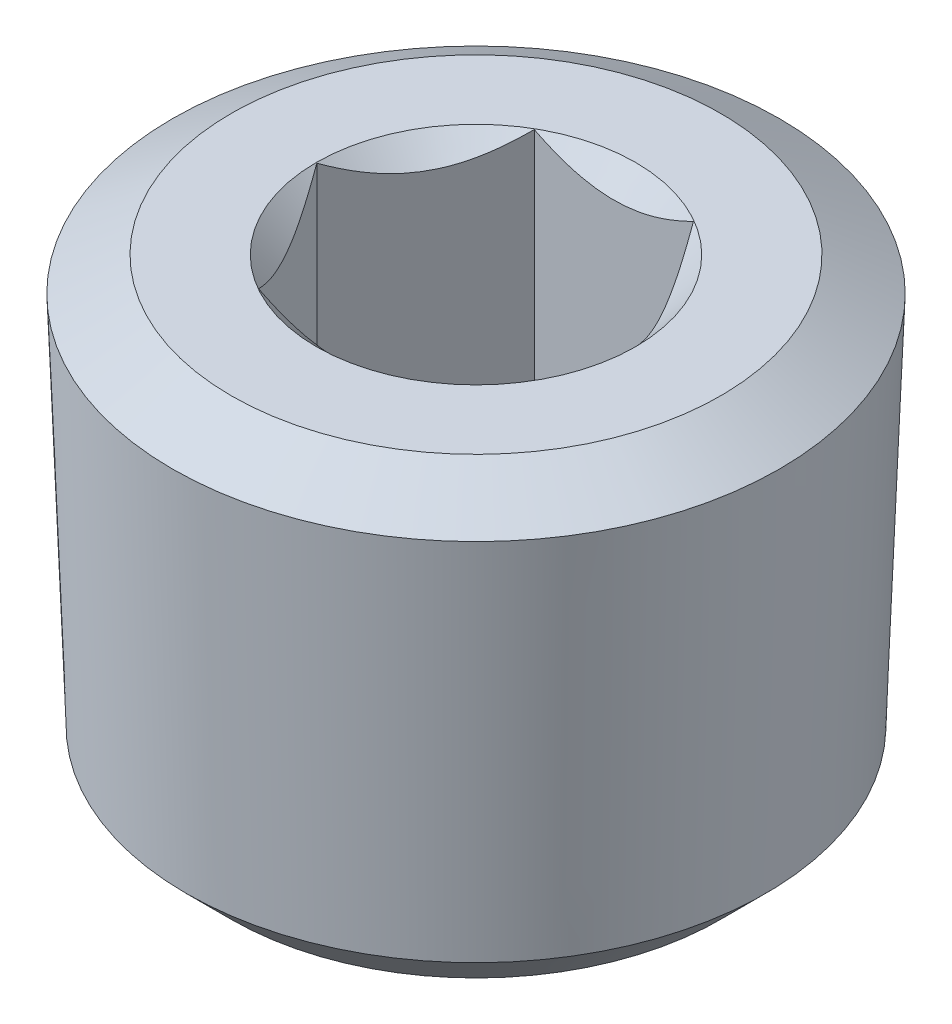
ISO-10303-21;
HEADER;
FILE_DESCRIPTION(('STEP AP214'),'2;1');
FILE_NAME('part.step','',(''),(''),'','','');
FILE_SCHEMA(('AUTOMOTIVE_DESIGN { 1 0 10303 214 1 1 1 1 }'));
ENDSEC;
DATA;
#1=APPLICATION_CONTEXT('core data for automotive mechanical design processes');
#2=APPLICATION_PROTOCOL_DEFINITION('international standard','automotive_design',2000,#1);
#3=PRODUCT_CONTEXT('',#1,'mechanical');
#4=PRODUCT('Part','Part','',(#3));
#5=PRODUCT_RELATED_PRODUCT_CATEGORY('part','',(#4));
#6=PRODUCT_DEFINITION_FORMATION('','',#4);
#7=PRODUCT_DEFINITION_CONTEXT('part definition',#1,'design');
#8=PRODUCT_DEFINITION('design','',#6,#7);
#9=PRODUCT_DEFINITION_SHAPE('','',#8);
#10=(LENGTH_UNIT() NAMED_UNIT(*) SI_UNIT(.MILLI.,.METRE.));
#11=(NAMED_UNIT(*) PLANE_ANGLE_UNIT() SI_UNIT($,.RADIAN.));
#12=(NAMED_UNIT(*) SI_UNIT($,.STERADIAN.) SOLID_ANGLE_UNIT());
#13=UNCERTAINTY_MEASURE_WITH_UNIT(LENGTH_MEASURE(1.E-05),#10,'distance_accuracy_value','');
#14=(GEOMETRIC_REPRESENTATION_CONTEXT(3) GLOBAL_UNCERTAINTY_ASSIGNED_CONTEXT((#13)) GLOBAL_UNIT_ASSIGNED_CONTEXT((#10,
#11,#12)) REPRESENTATION_CONTEXT('',''));
#15=CARTESIAN_POINT('',(0.,0.,0.));
#16=DIRECTION('',(0.,0.,1.));
#17=DIRECTION('',(1.,0.,0.));
#18=AXIS2_PLACEMENT_3D('',#15,#16,#17);
#19=CARTESIAN_POINT('',(0.,0.,0.));
#20=DIRECTION('',(0.,1.,0.));
#21=DIRECTION('',(0.,0.,1.));
#22=AXIS2_PLACEMENT_3D('',#19,#20,#21);
#23=PLANE('',#22);
#24=CARTESIAN_POINT('',(0.,0.,0.));
#25=DIRECTION('',(0.,1.,0.));
#26=DIRECTION('',(0.,0.,1.));
#27=AXIS2_PLACEMENT_3D('',#24,#25,#26);
#28=CIRCLE('',#27,5.588);
#29=CARTESIAN_POINT('',(0.,0.,5.588));
#30=VERTEX_POINT('',#29);
#31=EDGE_CURVE('E238',#30,#30,#28,.T.);
#32=ORIENTED_EDGE('',*,*,#31,.F.);
#33=EDGE_LOOP('',(#32));
#34=FACE_BOUND('',#33,.T.);
#35=CARTESIAN_POINT('',(0.,0.,0.));
#36=DIRECTION('',(0.,1.,0.));
#37=DIRECTION('',(0.,0.,1.));
#38=AXIS2_PLACEMENT_3D('',#35,#36,#37);
#39=CIRCLE('',#38,8.56521947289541);
#40=CARTESIAN_POINT('',(0.,0.,8.56521947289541));
#41=VERTEX_POINT('',#40);
#42=EDGE_CURVE('E12',#41,#41,#39,.T.);
#43=ORIENTED_EDGE('',*,*,#42,.T.);
#44=EDGE_LOOP('',(#43));
#45=FACE_BOUND('',#44,.T.);
#46=ADVANCED_FACE('F33',(#34,#45),#23,.T.);
#47=CARTESIAN_POINT('',(0.,0.,0.));
#48=DIRECTION('',(0.,-1.,0.));
#49=DIRECTION('',(0.,0.,-1.));
#50=AXIS2_PLACEMENT_3D('',#47,#48,#49);
#51=CONICAL_SURFACE('',#50,8.56521947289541,1.0471975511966);
#52=CARTESIAN_POINT('',(0.,-1.18901290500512,0.));
#53=DIRECTION('',(0.,1.,0.));
#54=DIRECTION('',(0.,0.,1.));
#55=AXIS2_PLACEMENT_3D('',#52,#53,#54);
#56=CIRCLE('',#55,10.6246502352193);
#57=CARTESIAN_POINT('',(0.,-1.18901290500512,10.6246502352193));
#58=VERTEX_POINT('',#57);
#59=EDGE_CURVE('E40',#58,#58,#56,.T.);
#60=ORIENTED_EDGE('',*,*,#59,.T.);
#61=EDGE_LOOP('',(#60));
#62=FACE_BOUND('',#61,.T.);
#63=ORIENTED_EDGE('',*,*,#42,.F.);
#64=EDGE_LOOP('',(#63));
#65=FACE_BOUND('',#64,.T.);
#66=ADVANCED_FACE('F228',(#62,#65),#51,.T.);
#67=CARTESIAN_POINT('',(0.,-1.18901290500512,0.));
#68=DIRECTION('',(0.,1.,0.));
#69=DIRECTION('',(0.,0.,1.));
#70=AXIS2_PLACEMENT_3D('',#67,#68,#69);
#71=CONICAL_SURFACE('',#70,10.6246502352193,0.0364424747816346);
#72=CARTESIAN_POINT('',(0.,-14.2933346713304,0.));
#73=DIRECTION('',(0.,1.,0.));
#74=DIRECTION('',(0.,0.,1.));
#75=AXIS2_PLACEMENT_3D('',#72,#73,#74);
#76=CIRCLE('',#75,10.146884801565);
#77=CARTESIAN_POINT('',(0.,-14.2933346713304,10.146884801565));
#78=VERTEX_POINT('',#77);
#79=EDGE_CURVE('E246',#78,#78,#76,.T.);
#80=ORIENTED_EDGE('',*,*,#79,.T.);
#81=EDGE_LOOP('',(#80));
#82=FACE_BOUND('',#81,.T.);
#83=ORIENTED_EDGE('',*,*,#59,.F.);
#84=EDGE_LOOP('',(#83));
#85=FACE_BOUND('',#84,.T.);
#86=ADVANCED_FACE('F233',(#82,#85),#71,.T.);
#87=CARTESIAN_POINT('',(0.,-14.2933346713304,0.));
#88=DIRECTION('',(0.,1.,0.));
#89=DIRECTION('',(0.,0.,1.));
#90=AXIS2_PLACEMENT_3D('',#87,#88,#89);
#91=CONICAL_SURFACE('',#90,10.146884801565,0.785398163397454);
#92=CARTESIAN_POINT('',(0.,-15.875,0.));
#93=DIRECTION('',(0.,1.,0.));
#94=DIRECTION('',(0.,0.,1.));
#95=AXIS2_PLACEMENT_3D('',#92,#93,#94);
#96=CIRCLE('',#95,8.56521947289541);
#97=CARTESIAN_POINT('',(0.,-15.875,8.56521947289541));
#98=VERTEX_POINT('',#97);
#99=EDGE_CURVE('E242',#98,#98,#96,.T.);
#100=ORIENTED_EDGE('',*,*,#99,.T.);
#101=EDGE_LOOP('',(#100));
#102=FACE_BOUND('',#101,.T.);
#103=ORIENTED_EDGE('',*,*,#79,.F.);
#104=EDGE_LOOP('',(#103));
#105=FACE_BOUND('',#104,.T.);
#106=ADVANCED_FACE('F257',(#102,#105),#91,.T.);
#107=CARTESIAN_POINT('',(-8.56521947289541,-15.875,0.));
#108=DIRECTION('',(0.,-1.,0.));
#109=DIRECTION('',(0.,0.,-1.));
#110=AXIS2_PLACEMENT_3D('',#107,#108,#109);
#111=PLANE('',#110);
#112=ORIENTED_EDGE('',*,*,#99,.F.);
#113=EDGE_LOOP('',(#112));
#114=FACE_BOUND('',#113,.T.);
#115=ADVANCED_FACE('F175',(#114),#111,.T.);
#116=CARTESIAN_POINT('',(0.,0.,0.));
#117=DIRECTION('',(0.,1.,0.));
#118=DIRECTION('',(0.,0.,1.));
#119=AXIS2_PLACEMENT_3D('',#116,#117,#118);
#120=CONICAL_SURFACE('',#119,5.588,0.785398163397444);
#121=CARTESIAN_POINT('',(-5.82098732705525,1.97336029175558,4.826));
#122=CARTESIAN_POINT('',(-5.68037895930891,1.86513957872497,4.826));
#123=CARTESIAN_POINT('',(-5.53901367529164,1.75788686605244,4.826));
#124=CARTESIAN_POINT('',(-5.25445964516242,1.54575989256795,4.826));
#125=CARTESIAN_POINT('',(-5.11127047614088,1.44088619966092,4.826));
#126=CARTESIAN_POINT('',(-4.82171273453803,1.23321340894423,4.826));
#127=CARTESIAN_POINT('',(-4.67532815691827,1.13043655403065,4.826));
#128=CARTESIAN_POINT('',(-4.38012395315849,0.928453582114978,4.826));
#129=CARTESIAN_POINT('',(-4.23130449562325,0.829247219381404,4.826));
#130=CARTESIAN_POINT('',(-3.92127070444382,0.62905260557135,4.826));
#131=CARTESIAN_POINT('',(-3.75986976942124,0.528351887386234,4.826));
#132=CARTESIAN_POINT('',(-3.43327724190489,0.333192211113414,4.826));
#133=CARTESIAN_POINT('',(-3.26808501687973,0.238734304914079,4.826));
#134=CARTESIAN_POINT('',(-2.93386328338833,0.0580712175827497,4.826));
#135=CARTESIAN_POINT('',(-2.76484697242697,-0.0281581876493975,4.826));
#136=CARTESIAN_POINT('',(-2.42203255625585,-0.190432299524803,4.826));
#137=CARTESIAN_POINT('',(-2.24823675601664,-0.26648181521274,4.826));
#138=CARTESIAN_POINT('',(-1.9129593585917,-0.398742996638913,4.826));
#139=CARTESIAN_POINT('',(-1.75196353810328,-0.456173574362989,4.826));
#140=CARTESIAN_POINT('',(-1.42586489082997,-0.558148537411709,4.826));
#141=CARTESIAN_POINT('',(-1.26076180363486,-0.602692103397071,4.826));
#142=CARTESIAN_POINT('',(-0.930313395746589,-0.675737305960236,4.826));
#143=CARTESIAN_POINT('',(-0.765033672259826,-0.704530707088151,4.826));
#144=CARTESIAN_POINT('',(-0.432413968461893,-0.745473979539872,4.826));
#145=CARTESIAN_POINT('',(-0.265074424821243,-0.757627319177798,4.826));
#146=CARTESIAN_POINT('',(0.0626058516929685,-0.764252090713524,4.826));
#147=CARTESIAN_POINT('',(0.222931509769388,-0.759475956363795,4.826));
#148=CARTESIAN_POINT('',(0.542334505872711,-0.73423422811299,4.826));
#149=CARTESIAN_POINT('',(0.701411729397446,-0.713767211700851,4.826));
#150=CARTESIAN_POINT('',(1.01986275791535,-0.657954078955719,4.826));
#151=CARTESIAN_POINT('',(1.17918969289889,-0.622345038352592,4.826));
#152=CARTESIAN_POINT('',(1.49433390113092,-0.538225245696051,4.826));
#153=CARTESIAN_POINT('',(1.65015137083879,-0.489715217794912,4.826));
#154=CARTESIAN_POINT('',(1.96673903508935,-0.378863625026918,4.826));
#155=CARTESIAN_POINT('',(2.12728598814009,-0.315891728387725,4.826));
#156=CARTESIAN_POINT('',(2.44425109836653,-0.180218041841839,4.826));
#157=CARTESIAN_POINT('',(2.60066735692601,-0.107511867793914,4.826));
#158=CARTESIAN_POINT('',(2.91010924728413,0.0459062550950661,4.826));
#159=CARTESIAN_POINT('',(3.06312255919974,0.126642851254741,4.826));
#160=CARTESIAN_POINT('',(3.36564324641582,0.294345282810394,4.826));
#161=CARTESIAN_POINT('',(3.51515115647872,0.381310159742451,4.826));
#162=CARTESIAN_POINT('',(3.80381290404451,0.555835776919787,4.826));
#163=CARTESIAN_POINT('',(3.94311348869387,0.643155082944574,4.826));
#164=CARTESIAN_POINT('',(4.21932134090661,0.821511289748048,4.826));
#165=CARTESIAN_POINT('',(4.35622842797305,0.912548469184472,4.826));
#166=CARTESIAN_POINT('',(4.62686190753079,1.0969365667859,4.826));
#167=CARTESIAN_POINT('',(4.76060501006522,1.19026304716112,4.826));
#168=CARTESIAN_POINT('',(5.02625631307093,1.37941840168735,4.826));
#169=CARTESIAN_POINT('',(5.15816500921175,1.47524657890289,4.826));
#170=CARTESIAN_POINT('',(5.28930417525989,1.57209878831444,4.826));
#171=B_SPLINE_CURVE_WITH_KNOTS('',3,(#121,#122,#123,#124,#125,#126,#127,#128,#129,#130,#131,
#132,#133,#134,#135,#136,#137,#138,#139,#140,#141,#142,#143,#144,#145,#146,#147,#148,#149,#150,
#151,#152,#153,#154,#155,#156,#157,#158,#159,#160,#161,#162,#163,#164,#165,#166,#167,#168,#169,
#170),.UNSPECIFIED.,.F.,.F.,(4,2,2,2,2,2,2,2,2,2,2,2,2,2,2,2,2,2,2,2,2,2,2,2,4),(0.,
0.532308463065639,1.06474268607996,1.60128394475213,2.13778820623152,2.70839310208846,
3.27909389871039,3.8480591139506,4.41675459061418,4.92911037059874,5.44149871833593,
5.94404277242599,6.44648206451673,6.92687576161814,7.40731301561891,7.89645698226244,
8.38557349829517,8.90254275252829,9.41974562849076,9.93858801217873,10.4573507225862,
10.9504993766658,11.4436850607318,11.932911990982,12.4220040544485),.UNSPECIFIED.);
#172=CARTESIAN_POINT('',(2.78629239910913,-0.0154152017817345,4.826));
#173=VERTEX_POINT('',#172);
#174=CARTESIAN_POINT('',(-2.78629239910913,-0.0154152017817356,4.826));
#175=VERTEX_POINT('',#174);
#176=EDGE_CURVE('E47',#173,#175,#171,.F.);
#177=ORIENTED_EDGE('',*,*,#176,.T.);
#178=CARTESIAN_POINT('',(-2.78617692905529,-0.0152997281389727,4.8262));
#179=CARTESIAN_POINT('',(-2.83408610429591,-0.0632046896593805,4.74321887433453));
#180=CARTESIAN_POINT('',(-2.88236353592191,-0.109639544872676,4.65959990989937));
#181=CARTESIAN_POINT('',(-2.97972716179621,-0.199121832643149,4.49096116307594));
#182=CARTESIAN_POINT('',(-3.02881378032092,-0.242167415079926,4.4059406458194));
#183=CARTESIAN_POINT('',(-3.17785183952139,-0.365916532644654,4.14779915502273));
#184=CARTESIAN_POINT('',(-3.27906498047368,-0.440704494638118,3.97249285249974));
#185=CARTESIAN_POINT('',(-3.48316938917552,-0.568773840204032,3.61897364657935));
#186=CARTESIAN_POINT('',(-3.58600848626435,-0.622377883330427,3.44085110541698));
#187=CARTESIAN_POINT('',(-3.74195789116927,-0.684384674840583,3.17073881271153));
#188=CARTESIAN_POINT('',(-3.794170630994,-0.701978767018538,3.08030369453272));
#189=CARTESIAN_POINT('',(-3.8990382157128,-0.730635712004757,2.89866770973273));
#190=CARTESIAN_POINT('',(-3.95169299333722,-0.741699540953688,2.80746695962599));
#191=CARTESIAN_POINT('',(-4.08000416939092,-0.760249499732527,2.58522548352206));
#192=CARTESIAN_POINT('',(-4.15579881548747,-0.764141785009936,2.45394530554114));
#193=CARTESIAN_POINT('',(-4.30725151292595,-0.757609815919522,2.19162153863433));
#194=CARTESIAN_POINT('',(-4.38290950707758,-0.747180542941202,2.06057804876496));
#195=CARTESIAN_POINT('',(-4.53351221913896,-0.712620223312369,1.79972649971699));
#196=CARTESIAN_POINT('',(-4.60845604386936,-0.688473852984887,1.66991998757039));
#197=CARTESIAN_POINT('',(-4.75705559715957,-0.627792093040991,1.41253801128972));
#198=CARTESIAN_POINT('',(-4.8307114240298,-0.591257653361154,1.28496237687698));
#199=CARTESIAN_POINT('',(-4.96146614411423,-0.516093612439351,1.0584885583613));
#200=CARTESIAN_POINT('',(-5.01885452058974,-0.479440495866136,0.959088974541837));
#201=CARTESIAN_POINT('',(-5.13260104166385,-0.40022749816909,0.762074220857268));
#202=CARTESIAN_POINT('',(-5.18895915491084,-0.357667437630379,0.664459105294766));
#203=CARTESIAN_POINT('',(-5.30046764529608,-0.267594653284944,0.471320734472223));
#204=CARTESIAN_POINT('',(-5.35562119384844,-0.220097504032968,0.375791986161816));
#205=CARTESIAN_POINT('',(-5.46490695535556,-0.120774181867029,0.186503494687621));
#206=CARTESIAN_POINT('',(-5.5190397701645,-0.0689506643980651,0.0927427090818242));
#207=CARTESIAN_POINT('',(-5.5727002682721,-0.0152997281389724,-0.000199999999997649));
#208=B_SPLINE_CURVE_WITH_KNOTS('',3,(#178,#179,#180,#181,#182,#183,#184,#185,#186,#187,#188,
#189,#190,#191,#192,#193,#194,#195,#196,#197,#198,#199,#200,#201,#202,#203,#204,#205,#206,#207),
.UNSPECIFIED.,.F.,.F.,(4,2,2,2,2,2,2,2,2,2,2,2,2,2,4),(0.,0.321360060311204,0.64289434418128,
1.28943446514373,1.92570770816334,2.24322028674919,2.56068539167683,3.01489632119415,
3.46926645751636,3.92414518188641,4.37898903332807,4.74028088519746,5.10158371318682,
5.46177950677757,5.82175582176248),.UNSPECIFIED.);
#209=CARTESIAN_POINT('',(-5.57258479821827,-0.0154152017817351,0.));
#210=VERTEX_POINT('',#209);
#211=EDGE_CURVE('E119',#175,#210,#208,.T.);
#212=ORIENTED_EDGE('',*,*,#211,.T.);
#213=CARTESIAN_POINT('',(-5.5727002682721,-0.0152997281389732,0.000200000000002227));
#214=CARTESIAN_POINT('',(-5.52479109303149,-0.0632046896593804,-0.0827811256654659));
#215=CARTESIAN_POINT('',(-5.47651366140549,-0.109639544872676,-0.16640009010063));
#216=CARTESIAN_POINT('',(-5.37915003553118,-0.199121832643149,-0.335038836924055));
#217=CARTESIAN_POINT('',(-5.33006341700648,-0.242167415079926,-0.420059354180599));
#218=CARTESIAN_POINT('',(-5.18102535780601,-0.365916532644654,-0.678200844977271));
#219=CARTESIAN_POINT('',(-5.07981221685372,-0.440704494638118,-0.853507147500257));
#220=CARTESIAN_POINT('',(-4.87570780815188,-0.568773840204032,-1.20702635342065));
#221=CARTESIAN_POINT('',(-4.77286871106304,-0.622377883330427,-1.38514889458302));
#222=CARTESIAN_POINT('',(-4.61691930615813,-0.684384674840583,-1.65526118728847));
#223=CARTESIAN_POINT('',(-4.5647065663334,-0.701978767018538,-1.74569630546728));
#224=CARTESIAN_POINT('',(-4.4598389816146,-0.730635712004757,-1.92733229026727));
#225=CARTESIAN_POINT('',(-4.40718420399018,-0.741699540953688,-2.01853304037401));
#226=CARTESIAN_POINT('',(-4.27887302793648,-0.760249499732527,-2.24077451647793));
#227=CARTESIAN_POINT('',(-4.20307838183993,-0.764141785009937,-2.37205469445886));
#228=CARTESIAN_POINT('',(-4.05162568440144,-0.757609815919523,-2.63437846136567));
#229=CARTESIAN_POINT('',(-3.97596769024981,-0.747180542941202,-2.76542195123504));
#230=CARTESIAN_POINT('',(-3.82536497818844,-0.71262022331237,-3.02627350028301));
#231=CARTESIAN_POINT('',(-3.75042115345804,-0.688473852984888,-3.15608001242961));
#232=CARTESIAN_POINT('',(-3.60182160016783,-0.627792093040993,-3.41346198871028));
#233=CARTESIAN_POINT('',(-3.5281657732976,-0.591257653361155,-3.54103762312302));
#234=CARTESIAN_POINT('',(-3.39741105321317,-0.516093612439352,-3.76751144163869));
#235=CARTESIAN_POINT('',(-3.34002267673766,-0.479440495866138,-3.86691102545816));
#236=CARTESIAN_POINT('',(-3.22627615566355,-0.400227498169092,-4.06392577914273));
#237=CARTESIAN_POINT('',(-3.16991804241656,-0.357667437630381,-4.16154089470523));
#238=CARTESIAN_POINT('',(-3.05840955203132,-0.267594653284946,-4.35467926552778));
#239=CARTESIAN_POINT('',(-3.00325600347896,-0.220097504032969,-4.45020801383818));
#240=CARTESIAN_POINT('',(-2.89397024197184,-0.120774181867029,-4.63949650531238));
#241=CARTESIAN_POINT('',(-2.8398374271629,-0.0689506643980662,-4.73325729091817));
#242=CARTESIAN_POINT('',(-2.7861769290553,-0.0152997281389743,-4.8262));
#243=B_SPLINE_CURVE_WITH_KNOTS('',3,(#213,#214,#215,#216,#217,#218,#219,#220,#221,#222,#223,
#224,#225,#226,#227,#228,#229,#230,#231,#232,#233,#234,#235,#236,#237,#238,#239,#240,#241,#242),
.UNSPECIFIED.,.F.,.F.,(4,2,2,2,2,2,2,2,2,2,2,2,2,2,4),(0.,0.321360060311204,0.642894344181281,
1.28943446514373,1.92570770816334,2.24322028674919,2.56068539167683,3.01489632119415,
3.46926645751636,3.92414518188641,4.37898903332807,4.74028088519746,5.10158371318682,
5.46177950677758,5.82175582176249),.UNSPECIFIED.);
#244=CARTESIAN_POINT('',(-2.78629239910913,-0.0154152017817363,-4.826));
#245=VERTEX_POINT('',#244);
#246=EDGE_CURVE('E197',#210,#245,#243,.T.);
#247=ORIENTED_EDGE('',*,*,#246,.T.);
#248=CARTESIAN_POINT('',(-5.82098732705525,1.97336029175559,-4.826));
#249=CARTESIAN_POINT('',(-5.68037895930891,1.86513957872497,-4.826));
#250=CARTESIAN_POINT('',(-5.53901367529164,1.75788686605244,-4.826));
#251=CARTESIAN_POINT('',(-5.25445964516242,1.54575989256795,-4.826));
#252=CARTESIAN_POINT('',(-5.11127047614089,1.44088619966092,-4.826));
#253=CARTESIAN_POINT('',(-4.82171273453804,1.23321340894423,-4.826));
#254=CARTESIAN_POINT('',(-4.67532815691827,1.13043655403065,-4.826));
#255=CARTESIAN_POINT('',(-4.3801239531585,0.928453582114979,-4.826));
#256=CARTESIAN_POINT('',(-4.23130449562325,0.829247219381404,-4.826));
#257=CARTESIAN_POINT('',(-3.92127070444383,0.629052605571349,-4.826));
#258=CARTESIAN_POINT('',(-3.75986976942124,0.528351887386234,-4.826));
#259=CARTESIAN_POINT('',(-3.43327724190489,0.333192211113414,-4.826));
#260=CARTESIAN_POINT('',(-3.26808501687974,0.238734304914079,-4.826));
#261=CARTESIAN_POINT('',(-2.93386328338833,0.0580712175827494,-4.826));
#262=CARTESIAN_POINT('',(-2.76484697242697,-0.0281581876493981,-4.826));
#263=CARTESIAN_POINT('',(-2.42203255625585,-0.190432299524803,-4.826));
#264=CARTESIAN_POINT('',(-2.24823675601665,-0.266481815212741,-4.826));
#265=CARTESIAN_POINT('',(-1.9129593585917,-0.398742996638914,-4.826));
#266=CARTESIAN_POINT('',(-1.75196353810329,-0.45617357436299,-4.826));
#267=CARTESIAN_POINT('',(-1.42586489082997,-0.558148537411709,-4.826));
#268=CARTESIAN_POINT('',(-1.26076180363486,-0.602692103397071,-4.826));
#269=CARTESIAN_POINT('',(-0.930313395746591,-0.675737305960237,-4.826));
#270=CARTESIAN_POINT('',(-0.765033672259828,-0.704530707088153,-4.826));
#271=CARTESIAN_POINT('',(-0.432413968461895,-0.745473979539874,-4.826));
#272=CARTESIAN_POINT('',(-0.265074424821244,-0.757627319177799,-4.826));
#273=CARTESIAN_POINT('',(0.0626058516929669,-0.764252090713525,-4.826));
#274=CARTESIAN_POINT('',(0.222931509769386,-0.759475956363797,-4.826));
#275=CARTESIAN_POINT('',(0.542334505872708,-0.734234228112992,-4.826));
#276=CARTESIAN_POINT('',(0.701411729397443,-0.713767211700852,-4.826));
#277=CARTESIAN_POINT('',(1.01986275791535,-0.657954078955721,-4.826));
#278=CARTESIAN_POINT('',(1.17918969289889,-0.622345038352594,-4.826));
#279=CARTESIAN_POINT('',(1.49433390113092,-0.538225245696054,-4.826));
#280=CARTESIAN_POINT('',(1.65015137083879,-0.489715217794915,-4.826));
#281=CARTESIAN_POINT('',(1.96673903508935,-0.378863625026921,-4.826));
#282=CARTESIAN_POINT('',(2.12728598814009,-0.315891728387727,-4.826));
#283=CARTESIAN_POINT('',(2.44425109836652,-0.180218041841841,-4.826));
#284=CARTESIAN_POINT('',(2.60066735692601,-0.107511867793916,-4.826));
#285=CARTESIAN_POINT('',(2.91010924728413,0.0459062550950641,-4.826));
#286=CARTESIAN_POINT('',(3.06312255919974,0.126642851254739,-4.826));
#287=CARTESIAN_POINT('',(3.36564324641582,0.294345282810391,-4.826));
#288=CARTESIAN_POINT('',(3.51515115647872,0.381310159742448,-4.826));
#289=CARTESIAN_POINT('',(3.80381290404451,0.555835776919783,-4.826));
#290=CARTESIAN_POINT('',(3.94311348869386,0.643155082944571,-4.826));
#291=CARTESIAN_POINT('',(4.21932134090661,0.821511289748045,-4.826));
#292=CARTESIAN_POINT('',(4.35622842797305,0.912548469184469,-4.826));
#293=CARTESIAN_POINT('',(4.62686190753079,1.09693656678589,-4.826));
#294=CARTESIAN_POINT('',(4.76060501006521,1.19026304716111,-4.826));
#295=CARTESIAN_POINT('',(5.02625631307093,1.37941840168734,-4.826));
#296=CARTESIAN_POINT('',(5.15816500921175,1.47524657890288,-4.826));
#297=CARTESIAN_POINT('',(5.28930417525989,1.57209878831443,-4.826));
#298=B_SPLINE_CURVE_WITH_KNOTS('',3,(#248,#249,#250,#251,#252,#253,#254,#255,#256,#257,#258,
#259,#260,#261,#262,#263,#264,#265,#266,#267,#268,#269,#270,#271,#272,#273,#274,#275,#276,#277,
#278,#279,#280,#281,#282,#283,#284,#285,#286,#287,#288,#289,#290,#291,#292,#293,#294,#295,#296,
#297),.UNSPECIFIED.,.F.,.F.,(4,2,2,2,2,2,2,2,2,2,2,2,2,2,2,2,2,2,2,2,2,2,2,2,4),(0.,
0.532308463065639,1.06474268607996,1.60128394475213,2.13778820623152,2.70839310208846,
3.27909389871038,3.8480591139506,4.41675459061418,4.92911037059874,5.44149871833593,
5.94404277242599,6.44648206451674,6.92687576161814,7.40731301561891,7.89645698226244,
8.38557349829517,8.90254275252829,9.41974562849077,9.93858801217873,10.4573507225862,
10.9504993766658,11.4436850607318,11.932911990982,12.4220040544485),.UNSPECIFIED.);
#299=CARTESIAN_POINT('',(2.78629239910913,-0.0154152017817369,-4.826));
#300=VERTEX_POINT('',#299);
#301=EDGE_CURVE('E191',#245,#300,#298,.T.);
#302=ORIENTED_EDGE('',*,*,#301,.T.);
#303=CARTESIAN_POINT('',(2.78617692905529,-0.0152997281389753,-4.8262));
#304=CARTESIAN_POINT('',(2.83408610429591,-0.063204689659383,-4.74321887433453));
#305=CARTESIAN_POINT('',(2.88236353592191,-0.109639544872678,-4.65959990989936));
#306=CARTESIAN_POINT('',(2.97972716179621,-0.199121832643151,-4.49096116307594));
#307=CARTESIAN_POINT('',(3.02881378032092,-0.242167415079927,-4.4059406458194));
#308=CARTESIAN_POINT('',(3.17785183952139,-0.365916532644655,-4.14779915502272));
#309=CARTESIAN_POINT('',(3.27906498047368,-0.440704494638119,-3.97249285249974));
#310=CARTESIAN_POINT('',(3.48316938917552,-0.568773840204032,-3.61897364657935));
#311=CARTESIAN_POINT('',(3.58600848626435,-0.622377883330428,-3.44085110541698));
#312=CARTESIAN_POINT('',(3.74195789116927,-0.684384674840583,-3.17073881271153));
#313=CARTESIAN_POINT('',(3.794170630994,-0.701978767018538,-3.08030369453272));
#314=CARTESIAN_POINT('',(3.8990382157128,-0.730635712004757,-2.89866770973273));
#315=CARTESIAN_POINT('',(3.95169299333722,-0.741699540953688,-2.80746695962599));
#316=CARTESIAN_POINT('',(4.08000416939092,-0.760249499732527,-2.58522548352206));
#317=CARTESIAN_POINT('',(4.15579881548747,-0.764141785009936,-2.45394530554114));
#318=CARTESIAN_POINT('',(4.30725151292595,-0.757609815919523,-2.19162153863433));
#319=CARTESIAN_POINT('',(4.38290950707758,-0.747180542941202,-2.06057804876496));
#320=CARTESIAN_POINT('',(4.53351221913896,-0.71262022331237,-1.79972649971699));
#321=CARTESIAN_POINT('',(4.60845604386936,-0.688473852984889,-1.66991998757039));
#322=CARTESIAN_POINT('',(4.75705559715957,-0.627792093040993,-1.41253801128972));
#323=CARTESIAN_POINT('',(4.8307114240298,-0.591257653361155,-1.28496237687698));
#324=CARTESIAN_POINT('',(4.96146614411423,-0.516093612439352,-1.05848855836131));
#325=CARTESIAN_POINT('',(5.01885452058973,-0.479440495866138,-0.959088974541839));
#326=CARTESIAN_POINT('',(5.13260104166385,-0.400227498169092,-0.762074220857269));
#327=CARTESIAN_POINT('',(5.18895915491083,-0.35766743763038,-0.664459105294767));
#328=CARTESIAN_POINT('',(5.30046764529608,-0.267594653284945,-0.471320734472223));
#329=CARTESIAN_POINT('',(5.35562119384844,-0.220097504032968,-0.375791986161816));
#330=CARTESIAN_POINT('',(5.46490695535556,-0.120774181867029,-0.18650349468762));
#331=CARTESIAN_POINT('',(5.5190397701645,-0.0689506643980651,-0.0927427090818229));
#332=CARTESIAN_POINT('',(5.5727002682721,-0.0152997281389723,0.000199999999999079));
#333=B_SPLINE_CURVE_WITH_KNOTS('',3,(#303,#304,#305,#306,#307,#308,#309,#310,#311,#312,#313,
#314,#315,#316,#317,#318,#319,#320,#321,#322,#323,#324,#325,#326,#327,#328,#329,#330,#331,#332),
.UNSPECIFIED.,.F.,.F.,(4,2,2,2,2,2,2,2,2,2,2,2,2,2,4),(0.,0.321360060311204,0.64289434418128,
1.28943446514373,1.92570770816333,2.24322028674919,2.56068539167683,3.01489632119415,
3.46926645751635,3.9241451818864,4.37898903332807,4.74028088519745,5.10158371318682,
5.46177950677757,5.82175582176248),.UNSPECIFIED.);
#334=CARTESIAN_POINT('',(5.57258479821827,-0.0154152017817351,0.));
#335=VERTEX_POINT('',#334);
#336=EDGE_CURVE('E185',#300,#335,#333,.T.);
#337=ORIENTED_EDGE('',*,*,#336,.T.);
#338=CARTESIAN_POINT('',(5.5727002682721,-0.0152997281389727,-0.000200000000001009));
#339=CARTESIAN_POINT('',(5.52479109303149,-0.0632046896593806,0.0827811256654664));
#340=CARTESIAN_POINT('',(5.47651366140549,-0.109639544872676,0.166400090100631));
#341=CARTESIAN_POINT('',(5.37915003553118,-0.199121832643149,0.335038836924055));
#342=CARTESIAN_POINT('',(5.33006341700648,-0.242167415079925,0.420059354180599));
#343=CARTESIAN_POINT('',(5.18102535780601,-0.365916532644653,0.678200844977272));
#344=CARTESIAN_POINT('',(5.07981221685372,-0.440704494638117,0.853507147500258));
#345=CARTESIAN_POINT('',(4.87570780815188,-0.568773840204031,1.20702635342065));
#346=CARTESIAN_POINT('',(4.77286871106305,-0.622377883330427,1.38514889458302));
#347=CARTESIAN_POINT('',(4.61691930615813,-0.684384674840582,1.65526118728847));
#348=CARTESIAN_POINT('',(4.5647065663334,-0.701978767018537,1.74569630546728));
#349=CARTESIAN_POINT('',(4.4598389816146,-0.730635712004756,1.92733229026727));
#350=CARTESIAN_POINT('',(4.40718420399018,-0.741699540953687,2.01853304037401));
#351=CARTESIAN_POINT('',(4.27887302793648,-0.760249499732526,2.24077451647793));
#352=CARTESIAN_POINT('',(4.20307838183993,-0.764141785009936,2.37205469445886));
#353=CARTESIAN_POINT('',(4.05162568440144,-0.757609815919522,2.63437846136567));
#354=CARTESIAN_POINT('',(3.97596769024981,-0.747180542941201,2.76542195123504));
#355=CARTESIAN_POINT('',(3.82536497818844,-0.712620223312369,3.02627350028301));
#356=CARTESIAN_POINT('',(3.75042115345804,-0.688473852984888,3.15608001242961));
#357=CARTESIAN_POINT('',(3.60182160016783,-0.627792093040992,3.41346198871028));
#358=CARTESIAN_POINT('',(3.5281657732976,-0.591257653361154,3.54103762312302));
#359=CARTESIAN_POINT('',(3.39741105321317,-0.516093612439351,3.7675114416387));
#360=CARTESIAN_POINT('',(3.34002267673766,-0.479440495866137,3.86691102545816));
#361=CARTESIAN_POINT('',(3.22627615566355,-0.400227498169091,4.06392577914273));
#362=CARTESIAN_POINT('',(3.16991804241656,-0.357667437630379,4.16154089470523));
#363=CARTESIAN_POINT('',(3.05840955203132,-0.267594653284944,4.35467926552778));
#364=CARTESIAN_POINT('',(3.00325600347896,-0.220097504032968,4.45020801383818));
#365=CARTESIAN_POINT('',(2.89397024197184,-0.120774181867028,4.63949650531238));
#366=CARTESIAN_POINT('',(2.8398374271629,-0.0689506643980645,4.73325729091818));
#367=CARTESIAN_POINT('',(2.7861769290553,-0.0152997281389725,4.8262));
#368=B_SPLINE_CURVE_WITH_KNOTS('',3,(#338,#339,#340,#341,#342,#343,#344,#345,#346,#347,#348,
#349,#350,#351,#352,#353,#354,#355,#356,#357,#358,#359,#360,#361,#362,#363,#364,#365,#366,#367),
.UNSPECIFIED.,.F.,.F.,(4,2,2,2,2,2,2,2,2,2,2,2,2,2,4),(0.,0.321360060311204,0.64289434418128,
1.28943446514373,1.92570770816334,2.24322028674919,2.56068539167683,3.01489632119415,
3.46926645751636,3.92414518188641,4.37898903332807,4.74028088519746,5.10158371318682,
5.46177950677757,5.82175582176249),.UNSPECIFIED.);
#369=EDGE_CURVE('E162',#335,#173,#368,.T.);
#370=ORIENTED_EDGE('',*,*,#369,.T.);
#371=EDGE_LOOP('',(#177,#212,#247,#302,#337,#370));
#372=FACE_BOUND('',#371,.T.);
#373=ORIENTED_EDGE('',*,*,#31,.T.);
#374=EDGE_LOOP('',(#373));
#375=FACE_BOUND('',#374,.T.);
#376=ADVANCED_FACE('F170',(#372,#375),#120,.F.);
#377=CARTESIAN_POINT('',(-5.57258479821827,-9.652,0.));
#378=DIRECTION('',(-0.866025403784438,0.,0.5));
#379=DIRECTION('',(0.5,0.,0.866025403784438));
#380=AXIS2_PLACEMENT_3D('',#377,#378,#379);
#381=PLANE('',#380);
#382=DIRECTION('',(0.,1.,0.));
#383=VECTOR('',#382,1.);
#384=CARTESIAN_POINT('',(-2.78629239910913,-9.652,4.826));
#385=LINE('',#384,#383);
#386=CARTESIAN_POINT('',(-2.78629239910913,-9.652,4.826));
#387=VERTEX_POINT('',#386);
#388=EDGE_CURVE('E116',#387,#175,#385,.T.);
#389=ORIENTED_EDGE('',*,*,#388,.F.);
#390=DIRECTION('',(0.5,0.,0.866025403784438));
#391=VECTOR('',#390,1.);
#392=CARTESIAN_POINT('',(-5.57258479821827,-9.652,0.));
#393=LINE('',#392,#391);
#394=CARTESIAN_POINT('',(-4.1794385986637,-9.652,2.413));
#395=VERTEX_POINT('',#394);
#396=EDGE_CURVE('E103',#395,#387,#393,.T.);
#397=ORIENTED_EDGE('',*,*,#396,.F.);
#398=CARTESIAN_POINT('',(-5.57258479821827,-9.652,0.));
#399=VERTEX_POINT('',#398);
#400=EDGE_CURVE('E113',#399,#395,#393,.T.);
#401=ORIENTED_EDGE('',*,*,#400,.F.);
#402=DIRECTION('',(0.,1.,0.));
#403=VECTOR('',#402,1.);
#404=CARTESIAN_POINT('',(-5.57258479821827,-9.652,0.));
#405=LINE('',#404,#403);
#406=EDGE_CURVE('E143',#399,#210,#405,.T.);
#407=ORIENTED_EDGE('',*,*,#406,.T.);
#408=ORIENTED_EDGE('',*,*,#211,.F.);
#409=EDGE_LOOP('',(#389,#397,#401,#407,#408));
#410=FACE_BOUND('',#409,.T.);
#411=ADVANCED_FACE('F117',(#410),#381,.F.);
#412=CARTESIAN_POINT('',(-2.78629239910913,-9.652,-4.826));
#413=DIRECTION('',(-0.866025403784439,0.,-0.5));
#414=DIRECTION('',(-0.5,0.,0.866025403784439));
#415=AXIS2_PLACEMENT_3D('',#412,#413,#414);
#416=PLANE('',#415);
#417=ORIENTED_EDGE('',*,*,#406,.F.);
#418=DIRECTION('',(-0.5,0.,0.866025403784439));
#419=VECTOR('',#418,1.);
#420=CARTESIAN_POINT('',(-2.78629239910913,-9.652,-4.826));
#421=LINE('',#420,#419);
#422=CARTESIAN_POINT('',(-4.1794385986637,-9.652,-2.413));
#423=VERTEX_POINT('',#422);
#424=EDGE_CURVE('E140',#423,#399,#421,.T.);
#425=ORIENTED_EDGE('',*,*,#424,.F.);
#426=CARTESIAN_POINT('',(-2.78629239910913,-9.652,-4.826));
#427=VERTEX_POINT('',#426);
#428=EDGE_CURVE('E122',#427,#423,#421,.T.);
#429=ORIENTED_EDGE('',*,*,#428,.F.);
#430=DIRECTION('',(0.,1.,0.));
#431=VECTOR('',#430,1.);
#432=CARTESIAN_POINT('',(-2.78629239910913,-9.652,-4.826));
#433=LINE('',#432,#431);
#434=EDGE_CURVE('E145',#427,#245,#433,.T.);
#435=ORIENTED_EDGE('',*,*,#434,.T.);
#436=ORIENTED_EDGE('',*,*,#246,.F.);
#437=EDGE_LOOP('',(#417,#425,#429,#435,#436));
#438=FACE_BOUND('',#437,.T.);
#439=ADVANCED_FACE('F206',(#438),#416,.F.);
#440=CARTESIAN_POINT('',(2.78629239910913,-9.652,-4.826));
#441=DIRECTION('',(0.,0.,-1.));
#442=DIRECTION('',(-1.,0.,0.));
#443=AXIS2_PLACEMENT_3D('',#440,#441,#442);
#444=PLANE('',#443);
#445=ORIENTED_EDGE('',*,*,#434,.F.);
#446=DIRECTION('',(-1.,0.,0.));
#447=VECTOR('',#446,1.);
#448=CARTESIAN_POINT('',(2.78629239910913,-9.652,-4.826));
#449=LINE('',#448,#447);
#450=CARTESIAN_POINT('',(0.,-9.652,-4.826));
#451=VERTEX_POINT('',#450);
#452=EDGE_CURVE('E136',#451,#427,#449,.T.);
#453=ORIENTED_EDGE('',*,*,#452,.F.);
#454=CARTESIAN_POINT('',(2.78629239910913,-9.652,-4.826));
#455=VERTEX_POINT('',#454);
#456=EDGE_CURVE('E137',#455,#451,#449,.T.);
#457=ORIENTED_EDGE('',*,*,#456,.F.);
#458=DIRECTION('',(0.,1.,0.));
#459=VECTOR('',#458,1.);
#460=CARTESIAN_POINT('',(2.78629239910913,-9.652,-4.826));
#461=LINE('',#460,#459);
#462=EDGE_CURVE('E148',#455,#300,#461,.T.);
#463=ORIENTED_EDGE('',*,*,#462,.T.);
#464=ORIENTED_EDGE('',*,*,#301,.F.);
#465=EDGE_LOOP('',(#445,#453,#457,#463,#464));
#466=FACE_BOUND('',#465,.T.);
#467=ADVANCED_FACE('F210',(#466),#444,.F.);
#468=CARTESIAN_POINT('',(5.57258479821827,-9.652,0.));
#469=DIRECTION('',(0.866025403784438,0.,-0.5));
#470=DIRECTION('',(-0.5,0.,-0.866025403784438));
#471=AXIS2_PLACEMENT_3D('',#468,#469,#470);
#472=PLANE('',#471);
#473=ORIENTED_EDGE('',*,*,#462,.F.);
#474=DIRECTION('',(-0.5,0.,-0.866025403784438));
#475=VECTOR('',#474,1.);
#476=CARTESIAN_POINT('',(5.57258479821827,-9.652,0.));
#477=LINE('',#476,#475);
#478=CARTESIAN_POINT('',(4.1794385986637,-9.652,-2.413));
#479=VERTEX_POINT('',#478);
#480=EDGE_CURVE('E132',#479,#455,#477,.T.);
#481=ORIENTED_EDGE('',*,*,#480,.F.);
#482=CARTESIAN_POINT('',(5.57258479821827,-9.652,0.));
#483=VERTEX_POINT('',#482);
#484=EDGE_CURVE('E133',#483,#479,#477,.T.);
#485=ORIENTED_EDGE('',*,*,#484,.F.);
#486=DIRECTION('',(0.,1.,0.));
#487=VECTOR('',#486,1.);
#488=CARTESIAN_POINT('',(5.57258479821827,-9.652,0.));
#489=LINE('',#488,#487);
#490=EDGE_CURVE('E151',#483,#335,#489,.T.);
#491=ORIENTED_EDGE('',*,*,#490,.T.);
#492=ORIENTED_EDGE('',*,*,#336,.F.);
#493=EDGE_LOOP('',(#473,#481,#485,#491,#492));
#494=FACE_BOUND('',#493,.T.);
#495=ADVANCED_FACE('F214',(#494),#472,.F.);
#496=CARTESIAN_POINT('',(2.78629239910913,-9.652,4.826));
#497=DIRECTION('',(0.866025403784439,0.,0.5));
#498=DIRECTION('',(0.5,0.,-0.866025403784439));
#499=AXIS2_PLACEMENT_3D('',#496,#497,#498);
#500=PLANE('',#499);
#501=ORIENTED_EDGE('',*,*,#490,.F.);
#502=DIRECTION('',(0.5,0.,-0.866025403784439));
#503=VECTOR('',#502,1.);
#504=CARTESIAN_POINT('',(2.78629239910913,-9.652,4.826));
#505=LINE('',#504,#503);
#506=CARTESIAN_POINT('',(4.1794385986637,-9.652,2.413));
#507=VERTEX_POINT('',#506);
#508=EDGE_CURVE('E128',#507,#483,#505,.T.);
#509=ORIENTED_EDGE('',*,*,#508,.F.);
#510=CARTESIAN_POINT('',(2.78629239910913,-9.652,4.826));
#511=VERTEX_POINT('',#510);
#512=EDGE_CURVE('E55',#511,#507,#505,.T.);
#513=ORIENTED_EDGE('',*,*,#512,.F.);
#514=DIRECTION('',(0.,1.,0.));
#515=VECTOR('',#514,1.);
#516=CARTESIAN_POINT('',(2.78629239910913,-9.652,4.826));
#517=LINE('',#516,#515);
#518=EDGE_CURVE('E121',#511,#173,#517,.T.);
#519=ORIENTED_EDGE('',*,*,#518,.T.);
#520=ORIENTED_EDGE('',*,*,#369,.F.);
#521=EDGE_LOOP('',(#501,#509,#513,#519,#520));
#522=FACE_BOUND('',#521,.T.);
#523=ADVANCED_FACE('F218',(#522),#500,.F.);
#524=CARTESIAN_POINT('',(-2.78629239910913,-9.652,4.826));
#525=DIRECTION('',(0.,0.,1.));
#526=DIRECTION('',(1.,0.,0.));
#527=AXIS2_PLACEMENT_3D('',#524,#525,#526);
#528=PLANE('',#527);
#529=ORIENTED_EDGE('',*,*,#518,.F.);
#530=DIRECTION('',(1.,0.,0.));
#531=VECTOR('',#530,1.);
#532=CARTESIAN_POINT('',(-2.78629239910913,-9.652,4.826));
#533=LINE('',#532,#531);
#534=CARTESIAN_POINT('',(0.,-9.652,4.826));
#535=VERTEX_POINT('',#534);
#536=EDGE_CURVE('E127',#535,#511,#533,.T.);
#537=ORIENTED_EDGE('',*,*,#536,.F.);
#538=EDGE_CURVE('E107',#387,#535,#533,.T.);
#539=ORIENTED_EDGE('',*,*,#538,.F.);
#540=ORIENTED_EDGE('',*,*,#388,.T.);
#541=ORIENTED_EDGE('',*,*,#176,.F.);
#542=EDGE_LOOP('',(#529,#537,#539,#540,#541));
#543=FACE_BOUND('',#542,.T.);
#544=ADVANCED_FACE('F126',(#543),#528,.F.);
#545=CARTESIAN_POINT('',(0.,-9.652,0.));
#546=DIRECTION('',(0.,1.,0.));
#547=DIRECTION('',(0.,0.,1.));
#548=AXIS2_PLACEMENT_3D('',#545,#546,#547);
#549=PLANE('',#548);
#550=CARTESIAN_POINT('',(0.,-9.652,0.));
#551=DIRECTION('',(0.,1.,0.));
#552=DIRECTION('',(0.,0.,1.));
#553=AXIS2_PLACEMENT_3D('',#550,#551,#552);
#554=CIRCLE('',#553,4.826);
#555=EDGE_CURVE('E109',#395,#535,#554,.T.);
#556=ORIENTED_EDGE('',*,*,#555,.F.);
#557=ORIENTED_EDGE('',*,*,#396,.T.);
#558=ORIENTED_EDGE('',*,*,#538,.T.);
#559=EDGE_LOOP('',(#556,#557,#558));
#560=FACE_BOUND('',#559,.T.);
#561=ADVANCED_FACE('F105',(#560),#549,.T.);
#562=EDGE_CURVE('E408',#423,#395,#554,.T.);
#563=ORIENTED_EDGE('',*,*,#562,.F.);
#564=ORIENTED_EDGE('',*,*,#424,.T.);
#565=ORIENTED_EDGE('',*,*,#400,.T.);
#566=EDGE_LOOP('',(#563,#564,#565));
#567=FACE_BOUND('',#566,.T.);
#568=ADVANCED_FACE('F314',(#567),#549,.T.);
#569=EDGE_CURVE('E419',#451,#423,#554,.T.);
#570=ORIENTED_EDGE('',*,*,#569,.F.);
#571=ORIENTED_EDGE('',*,*,#452,.T.);
#572=ORIENTED_EDGE('',*,*,#428,.T.);
#573=EDGE_LOOP('',(#570,#571,#572));
#574=FACE_BOUND('',#573,.T.);
#575=ADVANCED_FACE('F323',(#574),#549,.T.);
#576=EDGE_CURVE('E420',#479,#451,#554,.T.);
#577=ORIENTED_EDGE('',*,*,#576,.F.);
#578=ORIENTED_EDGE('',*,*,#480,.T.);
#579=ORIENTED_EDGE('',*,*,#456,.T.);
#580=EDGE_LOOP('',(#577,#578,#579));
#581=FACE_BOUND('',#580,.T.);
#582=ADVANCED_FACE('F332',(#581),#549,.T.);
#583=EDGE_CURVE('E249',#507,#479,#554,.T.);
#584=ORIENTED_EDGE('',*,*,#583,.F.);
#585=ORIENTED_EDGE('',*,*,#508,.T.);
#586=ORIENTED_EDGE('',*,*,#484,.T.);
#587=EDGE_LOOP('',(#584,#585,#586));
#588=FACE_BOUND('',#587,.T.);
#589=ADVANCED_FACE('F341',(#588),#549,.T.);
#590=EDGE_CURVE('E243',#535,#507,#554,.T.);
#591=ORIENTED_EDGE('',*,*,#590,.F.);
#592=ORIENTED_EDGE('',*,*,#536,.T.);
#593=ORIENTED_EDGE('',*,*,#512,.T.);
#594=EDGE_LOOP('',(#591,#592,#593));
#595=FACE_BOUND('',#594,.T.);
#596=ADVANCED_FACE('F315',(#595),#549,.T.);
#597=CARTESIAN_POINT('',(-0.598730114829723,-12.192,0.));
#598=DIRECTION('',(0.,-1.,0.));
#599=DIRECTION('',(0.,0.,-1.));
#600=AXIS2_PLACEMENT_3D('',#597,#598,#599);
#601=PLANE('',#600);
#602=CARTESIAN_POINT('',(0.,-12.192,0.));
#603=DIRECTION('',(0.,1.,0.));
#604=DIRECTION('',(0.,0.,1.));
#605=AXIS2_PLACEMENT_3D('',#602,#603,#604);
#606=CIRCLE('',#605,0.598730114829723);
#607=CARTESIAN_POINT('',(0.,-12.192,0.598730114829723));
#608=VERTEX_POINT('',#607);
#609=EDGE_CURVE('E407',#608,#608,#606,.T.);
#610=ORIENTED_EDGE('',*,*,#609,.T.);
#611=EDGE_LOOP('',(#610));
#612=FACE_BOUND('',#611,.T.);
#613=ADVANCED_FACE('F358',(#612),#601,.F.);
#614=CARTESIAN_POINT('',(0.,-9.652,0.));
#615=DIRECTION('',(0.,1.,0.));
#616=DIRECTION('',(0.,0.,1.));
#617=AXIS2_PLACEMENT_3D('',#614,#615,#616);
#618=CONICAL_SURFACE('',#617,4.826,1.02974425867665);
#619=ORIENTED_EDGE('',*,*,#609,.F.);
#620=EDGE_LOOP('',(#619));
#621=FACE_BOUND('',#620,.T.);
#622=ORIENTED_EDGE('',*,*,#590,.T.);
#623=ORIENTED_EDGE('',*,*,#583,.T.);
#624=ORIENTED_EDGE('',*,*,#576,.T.);
#625=ORIENTED_EDGE('',*,*,#569,.T.);
#626=ORIENTED_EDGE('',*,*,#562,.T.);
#627=ORIENTED_EDGE('',*,*,#555,.T.);
#628=EDGE_LOOP('',(#622,#623,#624,#625,#626,#627));
#629=FACE_BOUND('',#628,.T.);
#630=ADVANCED_FACE('F176',(#621,#629),#618,.F.);
#631=CLOSED_SHELL('',(#46,#66,#86,#106,#115,#376,#411,#439,#467,#495,#523,#544,#561,#568,#575,
#582,#589,#596,#613,#630));
#632=MANIFOLD_SOLID_BREP('B2',#631);
#633=ADVANCED_BREP_SHAPE_REPRESENTATION('',(#18,#632),#14);
#634=SHAPE_DEFINITION_REPRESENTATION(#9,#633);
ENDSEC;
END-ISO-10303-21;
